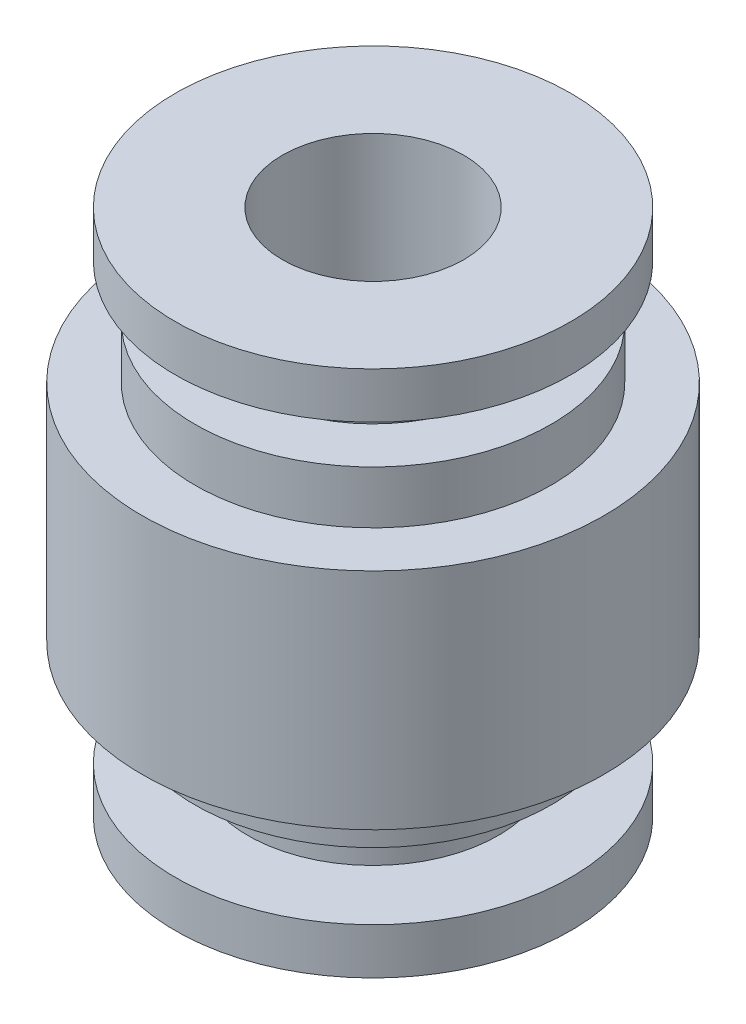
ISO-10303-21;
HEADER;
FILE_DESCRIPTION(('STEP AP214'),'2;1');
FILE_NAME('part.step','',(''),(''),'','','');
FILE_SCHEMA(('AUTOMOTIVE_DESIGN { 1 0 10303 214 1 1 1 1 }'));
ENDSEC;
DATA;
#1=APPLICATION_CONTEXT('core data for automotive mechanical design processes');
#2=APPLICATION_PROTOCOL_DEFINITION('international standard','automotive_design',2000,#1);
#3=PRODUCT_CONTEXT('',#1,'mechanical');
#4=PRODUCT('Part','Part','',(#3));
#5=PRODUCT_RELATED_PRODUCT_CATEGORY('part','',(#4));
#6=PRODUCT_DEFINITION_FORMATION('','',#4);
#7=PRODUCT_DEFINITION_CONTEXT('part definition',#1,'design');
#8=PRODUCT_DEFINITION('design','',#6,#7);
#9=PRODUCT_DEFINITION_SHAPE('','',#8);
#10=(LENGTH_UNIT() NAMED_UNIT(*) SI_UNIT(.MILLI.,.METRE.));
#11=(NAMED_UNIT(*) PLANE_ANGLE_UNIT() SI_UNIT($,.RADIAN.));
#12=(NAMED_UNIT(*) SI_UNIT($,.STERADIAN.) SOLID_ANGLE_UNIT());
#13=UNCERTAINTY_MEASURE_WITH_UNIT(LENGTH_MEASURE(1.E-05),#10,'distance_accuracy_value','');
#14=(GEOMETRIC_REPRESENTATION_CONTEXT(3) GLOBAL_UNCERTAINTY_ASSIGNED_CONTEXT((#13)) GLOBAL_UNIT_ASSIGNED_CONTEXT((#10,
#11,#12)) REPRESENTATION_CONTEXT('',''));
#15=CARTESIAN_POINT('',(0.,0.,0.));
#16=DIRECTION('',(0.,0.,1.));
#17=DIRECTION('',(1.,0.,0.));
#18=AXIS2_PLACEMENT_3D('',#15,#16,#17);
#19=CARTESIAN_POINT('',(3.4925,0.,0.));
#20=DIRECTION('',(0.,-1.,0.));
#21=DIRECTION('',(0.,0.,-1.));
#22=AXIS2_PLACEMENT_3D('',#19,#20,#21);
#23=PLANE('',#22);
#24=CARTESIAN_POINT('',(0.,0.,0.));
#25=DIRECTION('',(0.,-1.,0.));
#26=DIRECTION('',(0.,0.,-1.));
#27=AXIS2_PLACEMENT_3D('',#24,#25,#26);
#28=CIRCLE('',#27,7.62);
#29=CARTESIAN_POINT('',(0.,0.,-7.62));
#30=VERTEX_POINT('',#29);
#31=EDGE_CURVE('E10',#30,#30,#28,.T.);
#32=ORIENTED_EDGE('',*,*,#31,.T.);
#33=EDGE_LOOP('',(#32));
#34=FACE_BOUND('',#33,.T.);
#35=CARTESIAN_POINT('',(0.,0.,0.));
#36=DIRECTION('',(0.,-1.,0.));
#37=DIRECTION('',(0.,0.,-1.));
#38=AXIS2_PLACEMENT_3D('',#35,#36,#37);
#39=CIRCLE('',#38,3.4925);
#40=CARTESIAN_POINT('',(0.,0.,-3.4925));
#41=VERTEX_POINT('',#40);
#42=EDGE_CURVE('E98',#41,#41,#39,.T.);
#43=ORIENTED_EDGE('',*,*,#42,.F.);
#44=EDGE_LOOP('',(#43));
#45=FACE_BOUND('',#44,.T.);
#46=ADVANCED_FACE('F34',(#34,#45),#23,.T.);
#47=CARTESIAN_POINT('',(0.,0.,0.));
#48=DIRECTION('',(0.,-1.,0.));
#49=DIRECTION('',(0.,0.,-1.));
#50=AXIS2_PLACEMENT_3D('',#47,#48,#49);
#51=CYLINDRICAL_SURFACE('',#50,7.62);
#52=CARTESIAN_POINT('',(0.,1.778,0.));
#53=DIRECTION('',(0.,-1.,0.));
#54=DIRECTION('',(0.,0.,-1.));
#55=AXIS2_PLACEMENT_3D('',#52,#53,#54);
#56=CIRCLE('',#55,7.62);
#57=CARTESIAN_POINT('',(0.,1.778,-7.62));
#58=VERTEX_POINT('',#57);
#59=EDGE_CURVE('E41',#58,#58,#56,.T.);
#60=ORIENTED_EDGE('',*,*,#59,.T.);
#61=EDGE_LOOP('',(#60));
#62=FACE_BOUND('',#61,.T.);
#63=ORIENTED_EDGE('',*,*,#31,.F.);
#64=EDGE_LOOP('',(#63));
#65=FACE_BOUND('',#64,.T.);
#66=ADVANCED_FACE('F107',(#62,#65),#51,.T.);
#67=CARTESIAN_POINT('',(7.62,1.778,0.));
#68=DIRECTION('',(0.,1.,0.));
#69=DIRECTION('',(0.,0.,1.));
#70=AXIS2_PLACEMENT_3D('',#67,#68,#69);
#71=PLANE('',#70);
#72=CARTESIAN_POINT('',(0.,1.778,0.));
#73=DIRECTION('',(0.,-1.,0.));
#74=DIRECTION('',(0.,0.,-1.));
#75=AXIS2_PLACEMENT_3D('',#72,#73,#74);
#76=CIRCLE('',#75,4.826);
#77=CARTESIAN_POINT('',(0.,1.778,-4.826));
#78=VERTEX_POINT('',#77);
#79=EDGE_CURVE('E48',#78,#78,#76,.T.);
#80=ORIENTED_EDGE('',*,*,#79,.T.);
#81=EDGE_LOOP('',(#80));
#82=FACE_BOUND('',#81,.T.);
#83=ORIENTED_EDGE('',*,*,#59,.F.);
#84=EDGE_LOOP('',(#83));
#85=FACE_BOUND('',#84,.T.);
#86=ADVANCED_FACE('F111',(#82,#85),#71,.T.);
#87=CARTESIAN_POINT('',(0.,0.,0.));
#88=DIRECTION('',(0.,-1.,0.));
#89=DIRECTION('',(0.,0.,-1.));
#90=AXIS2_PLACEMENT_3D('',#87,#88,#89);
#91=CYLINDRICAL_SURFACE('',#90,4.826);
#92=CARTESIAN_POINT('',(0.,3.81,0.));
#93=DIRECTION('',(0.,-1.,0.));
#94=DIRECTION('',(0.,0.,-1.));
#95=AXIS2_PLACEMENT_3D('',#92,#93,#94);
#96=CIRCLE('',#95,4.826);
#97=CARTESIAN_POINT('',(0.,3.81,-4.826));
#98=VERTEX_POINT('',#97);
#99=EDGE_CURVE('E54',#98,#98,#96,.T.);
#100=ORIENTED_EDGE('',*,*,#99,.T.);
#101=EDGE_LOOP('',(#100));
#102=FACE_BOUND('',#101,.T.);
#103=ORIENTED_EDGE('',*,*,#79,.F.);
#104=EDGE_LOOP('',(#103));
#105=FACE_BOUND('',#104,.T.);
#106=ADVANCED_FACE('F115',(#102,#105),#91,.T.);
#107=CARTESIAN_POINT('',(4.826,3.81,0.));
#108=DIRECTION('',(0.,-1.,0.));
#109=DIRECTION('',(0.,0.,-1.));
#110=AXIS2_PLACEMENT_3D('',#107,#108,#109);
#111=PLANE('',#110);
#112=CARTESIAN_POINT('',(0.,3.81,0.));
#113=DIRECTION('',(0.,-1.,0.));
#114=DIRECTION('',(0.,0.,-1.));
#115=AXIS2_PLACEMENT_3D('',#112,#113,#114);
#116=CIRCLE('',#115,6.858);
#117=CARTESIAN_POINT('',(0.,3.81,-6.858));
#118=VERTEX_POINT('',#117);
#119=EDGE_CURVE('E59',#118,#118,#116,.T.);
#120=ORIENTED_EDGE('',*,*,#119,.T.);
#121=EDGE_LOOP('',(#120));
#122=FACE_BOUND('',#121,.T.);
#123=ORIENTED_EDGE('',*,*,#99,.F.);
#124=EDGE_LOOP('',(#123));
#125=FACE_BOUND('',#124,.T.);
#126=ADVANCED_FACE('F122',(#122,#125),#111,.T.);
#127=CARTESIAN_POINT('',(0.,0.,0.));
#128=DIRECTION('',(0.,-1.,0.));
#129=DIRECTION('',(0.,0.,-1.));
#130=AXIS2_PLACEMENT_3D('',#127,#128,#129);
#131=CYLINDRICAL_SURFACE('',#130,6.858);
#132=CARTESIAN_POINT('',(0.,5.842,0.));
#133=DIRECTION('',(0.,-1.,0.));
#134=DIRECTION('',(0.,0.,-1.));
#135=AXIS2_PLACEMENT_3D('',#132,#133,#134);
#136=CIRCLE('',#135,6.858);
#137=CARTESIAN_POINT('',(0.,5.842,-6.858));
#138=VERTEX_POINT('',#137);
#139=EDGE_CURVE('E62',#138,#138,#136,.T.);
#140=ORIENTED_EDGE('',*,*,#139,.T.);
#141=EDGE_LOOP('',(#140));
#142=FACE_BOUND('',#141,.T.);
#143=ORIENTED_EDGE('',*,*,#119,.F.);
#144=EDGE_LOOP('',(#143));
#145=FACE_BOUND('',#144,.T.);
#146=ADVANCED_FACE('F126',(#142,#145),#131,.T.);
#147=CARTESIAN_POINT('',(6.858,5.842,0.));
#148=DIRECTION('',(0.,-1.,0.));
#149=DIRECTION('',(0.,0.,-1.));
#150=AXIS2_PLACEMENT_3D('',#147,#148,#149);
#151=PLANE('',#150);
#152=CARTESIAN_POINT('',(0.,5.842,0.));
#153=DIRECTION('',(0.,-1.,0.));
#154=DIRECTION('',(0.,0.,-1.));
#155=AXIS2_PLACEMENT_3D('',#152,#153,#154);
#156=CIRCLE('',#155,8.89);
#157=CARTESIAN_POINT('',(0.,5.842,-8.89));
#158=VERTEX_POINT('',#157);
#159=EDGE_CURVE('E65',#158,#158,#156,.T.);
#160=ORIENTED_EDGE('',*,*,#159,.T.);
#161=EDGE_LOOP('',(#160));
#162=FACE_BOUND('',#161,.T.);
#163=ORIENTED_EDGE('',*,*,#139,.F.);
#164=EDGE_LOOP('',(#163));
#165=FACE_BOUND('',#164,.T.);
#166=ADVANCED_FACE('F130',(#162,#165),#151,.T.);
#167=CARTESIAN_POINT('',(0.,0.,0.));
#168=DIRECTION('',(0.,-1.,0.));
#169=DIRECTION('',(0.,0.,-1.));
#170=AXIS2_PLACEMENT_3D('',#167,#168,#169);
#171=CYLINDRICAL_SURFACE('',#170,8.89);
#172=CARTESIAN_POINT('',(0.,14.478,0.));
#173=DIRECTION('',(0.,-1.,0.));
#174=DIRECTION('',(0.,0.,-1.));
#175=AXIS2_PLACEMENT_3D('',#172,#173,#174);
#176=CIRCLE('',#175,8.89);
#177=CARTESIAN_POINT('',(0.,14.478,-8.89));
#178=VERTEX_POINT('',#177);
#179=EDGE_CURVE('E69',#178,#178,#176,.T.);
#180=ORIENTED_EDGE('',*,*,#179,.T.);
#181=EDGE_LOOP('',(#180));
#182=FACE_BOUND('',#181,.T.);
#183=ORIENTED_EDGE('',*,*,#159,.F.);
#184=EDGE_LOOP('',(#183));
#185=FACE_BOUND('',#184,.T.);
#186=ADVANCED_FACE('F134',(#182,#185),#171,.T.);
#187=CARTESIAN_POINT('',(6.858,14.478,0.));
#188=DIRECTION('',(0.,1.,0.));
#189=DIRECTION('',(0.,0.,1.));
#190=AXIS2_PLACEMENT_3D('',#187,#188,#189);
#191=PLANE('',#190);
#192=CARTESIAN_POINT('',(0.,14.478,0.));
#193=DIRECTION('',(0.,-1.,0.));
#194=DIRECTION('',(0.,0.,-1.));
#195=AXIS2_PLACEMENT_3D('',#192,#193,#194);
#196=CIRCLE('',#195,6.858);
#197=CARTESIAN_POINT('',(0.,14.478,-6.858));
#198=VERTEX_POINT('',#197);
#199=EDGE_CURVE('E73',#198,#198,#196,.T.);
#200=ORIENTED_EDGE('',*,*,#199,.T.);
#201=EDGE_LOOP('',(#200));
#202=FACE_BOUND('',#201,.T.);
#203=ORIENTED_EDGE('',*,*,#179,.F.);
#204=EDGE_LOOP('',(#203));
#205=FACE_BOUND('',#204,.T.);
#206=ADVANCED_FACE('F138',(#202,#205),#191,.T.);
#207=CARTESIAN_POINT('',(0.,0.,0.));
#208=DIRECTION('',(0.,-1.,0.));
#209=DIRECTION('',(0.,0.,-1.));
#210=AXIS2_PLACEMENT_3D('',#207,#208,#209);
#211=CYLINDRICAL_SURFACE('',#210,6.858);
#212=CARTESIAN_POINT('',(0.,16.51,0.));
#213=DIRECTION('',(0.,-1.,0.));
#214=DIRECTION('',(0.,0.,-1.));
#215=AXIS2_PLACEMENT_3D('',#212,#213,#214);
#216=CIRCLE('',#215,6.858);
#217=CARTESIAN_POINT('',(0.,16.51,-6.858));
#218=VERTEX_POINT('',#217);
#219=EDGE_CURVE('E77',#218,#218,#216,.T.);
#220=ORIENTED_EDGE('',*,*,#219,.T.);
#221=EDGE_LOOP('',(#220));
#222=FACE_BOUND('',#221,.T.);
#223=ORIENTED_EDGE('',*,*,#199,.F.);
#224=EDGE_LOOP('',(#223));
#225=FACE_BOUND('',#224,.T.);
#226=ADVANCED_FACE('F142',(#222,#225),#211,.T.);
#227=CARTESIAN_POINT('',(4.826,16.51,0.));
#228=DIRECTION('',(0.,1.,0.));
#229=DIRECTION('',(0.,0.,1.));
#230=AXIS2_PLACEMENT_3D('',#227,#228,#229);
#231=PLANE('',#230);
#232=CARTESIAN_POINT('',(0.,16.51,0.));
#233=DIRECTION('',(0.,-1.,0.));
#234=DIRECTION('',(0.,0.,-1.));
#235=AXIS2_PLACEMENT_3D('',#232,#233,#234);
#236=CIRCLE('',#235,4.826);
#237=CARTESIAN_POINT('',(0.,16.51,-4.826));
#238=VERTEX_POINT('',#237);
#239=EDGE_CURVE('E81',#238,#238,#236,.T.);
#240=ORIENTED_EDGE('',*,*,#239,.T.);
#241=EDGE_LOOP('',(#240));
#242=FACE_BOUND('',#241,.T.);
#243=ORIENTED_EDGE('',*,*,#219,.F.);
#244=EDGE_LOOP('',(#243));
#245=FACE_BOUND('',#244,.T.);
#246=ADVANCED_FACE('F146',(#242,#245),#231,.T.);
#247=CARTESIAN_POINT('',(0.,0.,0.));
#248=DIRECTION('',(0.,-1.,0.));
#249=DIRECTION('',(0.,0.,-1.));
#250=AXIS2_PLACEMENT_3D('',#247,#248,#249);
#251=CYLINDRICAL_SURFACE('',#250,4.826);
#252=CARTESIAN_POINT('',(0.,18.542,0.));
#253=DIRECTION('',(0.,-1.,0.));
#254=DIRECTION('',(0.,0.,-1.));
#255=AXIS2_PLACEMENT_3D('',#252,#253,#254);
#256=CIRCLE('',#255,4.826);
#257=CARTESIAN_POINT('',(0.,18.542,-4.826));
#258=VERTEX_POINT('',#257);
#259=EDGE_CURVE('E85',#258,#258,#256,.T.);
#260=ORIENTED_EDGE('',*,*,#259,.T.);
#261=EDGE_LOOP('',(#260));
#262=FACE_BOUND('',#261,.T.);
#263=ORIENTED_EDGE('',*,*,#239,.F.);
#264=EDGE_LOOP('',(#263));
#265=FACE_BOUND('',#264,.T.);
#266=ADVANCED_FACE('F150',(#262,#265),#251,.T.);
#267=CARTESIAN_POINT('',(7.62,18.542,0.));
#268=DIRECTION('',(0.,-1.,0.));
#269=DIRECTION('',(0.,0.,-1.));
#270=AXIS2_PLACEMENT_3D('',#267,#268,#269);
#271=PLANE('',#270);
#272=CARTESIAN_POINT('',(0.,18.542,0.));
#273=DIRECTION('',(0.,-1.,0.));
#274=DIRECTION('',(0.,0.,-1.));
#275=AXIS2_PLACEMENT_3D('',#272,#273,#274);
#276=CIRCLE('',#275,7.62);
#277=CARTESIAN_POINT('',(0.,18.542,-7.62));
#278=VERTEX_POINT('',#277);
#279=EDGE_CURVE('E88',#278,#278,#276,.T.);
#280=ORIENTED_EDGE('',*,*,#279,.T.);
#281=EDGE_LOOP('',(#280));
#282=FACE_BOUND('',#281,.T.);
#283=ORIENTED_EDGE('',*,*,#259,.F.);
#284=EDGE_LOOP('',(#283));
#285=FACE_BOUND('',#284,.T.);
#286=ADVANCED_FACE('F154',(#282,#285),#271,.T.);
#287=CARTESIAN_POINT('',(0.,0.,0.));
#288=DIRECTION('',(0.,-1.,0.));
#289=DIRECTION('',(0.,0.,-1.));
#290=AXIS2_PLACEMENT_3D('',#287,#288,#289);
#291=CYLINDRICAL_SURFACE('',#290,7.62);
#292=CARTESIAN_POINT('',(0.,20.32,0.));
#293=DIRECTION('',(0.,-1.,0.));
#294=DIRECTION('',(0.,0.,-1.));
#295=AXIS2_PLACEMENT_3D('',#292,#293,#294);
#296=CIRCLE('',#295,7.62);
#297=CARTESIAN_POINT('',(0.,20.32,-7.62));
#298=VERTEX_POINT('',#297);
#299=EDGE_CURVE('E92',#298,#298,#296,.T.);
#300=ORIENTED_EDGE('',*,*,#299,.T.);
#301=EDGE_LOOP('',(#300));
#302=FACE_BOUND('',#301,.T.);
#303=ORIENTED_EDGE('',*,*,#279,.F.);
#304=EDGE_LOOP('',(#303));
#305=FACE_BOUND('',#304,.T.);
#306=ADVANCED_FACE('F158',(#302,#305),#291,.T.);
#307=CARTESIAN_POINT('',(3.4925,20.32,0.));
#308=DIRECTION('',(0.,1.,0.));
#309=DIRECTION('',(0.,0.,1.));
#310=AXIS2_PLACEMENT_3D('',#307,#308,#309);
#311=PLANE('',#310);
#312=CARTESIAN_POINT('',(0.,20.32,0.));
#313=DIRECTION('',(0.,-1.,0.));
#314=DIRECTION('',(0.,0.,-1.));
#315=AXIS2_PLACEMENT_3D('',#312,#313,#314);
#316=CIRCLE('',#315,3.4925);
#317=CARTESIAN_POINT('',(0.,20.32,-3.4925));
#318=VERTEX_POINT('',#317);
#319=EDGE_CURVE('E95',#318,#318,#316,.T.);
#320=ORIENTED_EDGE('',*,*,#319,.T.);
#321=EDGE_LOOP('',(#320));
#322=FACE_BOUND('',#321,.T.);
#323=ORIENTED_EDGE('',*,*,#299,.F.);
#324=EDGE_LOOP('',(#323));
#325=FACE_BOUND('',#324,.T.);
#326=ADVANCED_FACE('F162',(#322,#325),#311,.T.);
#327=CARTESIAN_POINT('',(0.,0.,0.));
#328=DIRECTION('',(0.,-1.,0.));
#329=DIRECTION('',(0.,0.,-1.));
#330=AXIS2_PLACEMENT_3D('',#327,#328,#329);
#331=CYLINDRICAL_SURFACE('',#330,3.4925);
#332=ORIENTED_EDGE('',*,*,#42,.T.);
#333=EDGE_LOOP('',(#332));
#334=FACE_BOUND('',#333,.T.);
#335=ORIENTED_EDGE('',*,*,#319,.F.);
#336=EDGE_LOOP('',(#335));
#337=FACE_BOUND('',#336,.T.);
#338=ADVANCED_FACE('F103',(#334,#337),#331,.F.);
#339=CLOSED_SHELL('',(#46,#66,#86,#106,#126,#146,#166,#186,#206,#226,#246,#266,#286,#306,#326,#338));
#340=MANIFOLD_SOLID_BREP('B2',#339);
#341=ADVANCED_BREP_SHAPE_REPRESENTATION('',(#18,#340),#14);
#342=SHAPE_DEFINITION_REPRESENTATION(#9,#341);
ENDSEC;
END-ISO-10303-21;
